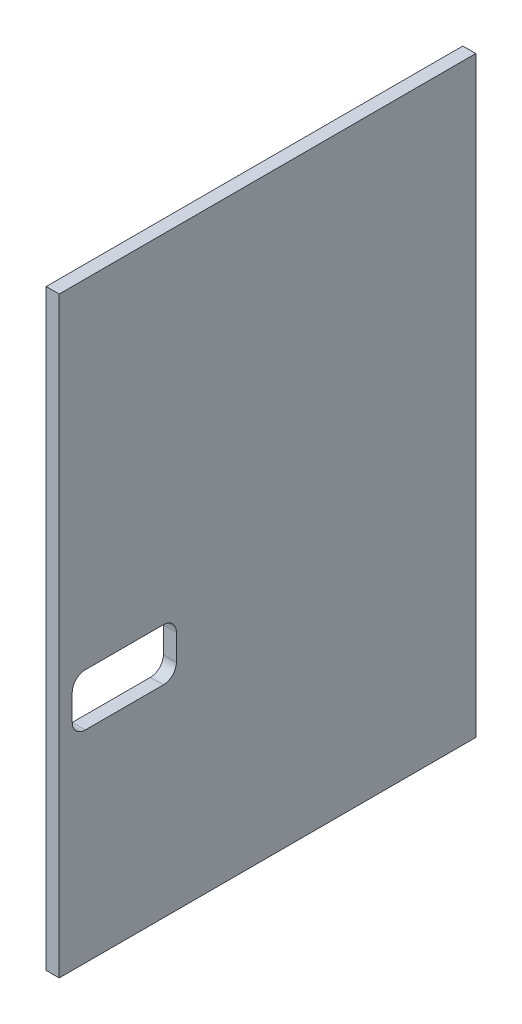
from build123d import *

# Parameters (mm, degrees)
SKETCH1_W           = 812.8
SKETCH1_H           = 1155.7
BOSS_EXTRUDE1_DEPTH = 25.4
CUT_EXTRUDE1_REACH  = 1415.128


with BuildPart() as part:
    # Sketch1 → Boss-Extrude1 (new body)
    with BuildSketch(Plane(origin=(0, 0, 0), x_dir=(0, 0, -1), z_dir=(1, 0, 0))):
        with Locations((406.4, 577.85)):
            Rectangle(SKETCH1_W, SKETCH1_H)
    extrude(amount=BOSS_EXTRUDE1_DEPTH)

    # Sketch3 → Cut-Extrude1 (cut, up to next)
    with BuildSketch(Plane(origin=(25.4, 0, 0), x_dir=(0, 0, -1), z_dir=(1, 0, 0)), mode=Mode.PRIVATE) as cut_extrude1_sk1:
        with BuildLine():
            Line((50.8, 495.3), (203.2, 495.3))
            ThreePointArc((203.2, 495.3), (221.160512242, 487.860512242), (228.6, 469.9))
            Line((228.6, 469.9), (228.6, 419.1))
            ThreePointArc((228.6, 419.1), (221.160512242, 401.139487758), (203.2, 393.7))
            Line((203.2, 393.7), (50.8, 393.7))
            ThreePointArc((50.8, 393.7), (32.839487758, 401.139487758), (25.4, 419.1))
            Line((25.4, 419.1), (25.4, 469.9))
            ThreePointArc((25.4, 469.9), (32.839487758, 487.860512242), (50.8, 495.3))
        make_face()
    cut_extrude1_tool1 = extrude(cut_extrude1_sk1.sketch, amount=-CUT_EXTRUDE1_REACH, mode=Mode.PRIVATE) & part.part
    add(cut_extrude1_tool1.solids().sort_by_distance((25.4, 444.5, -127))[0], mode=Mode.SUBTRACT)


solid = part.part
